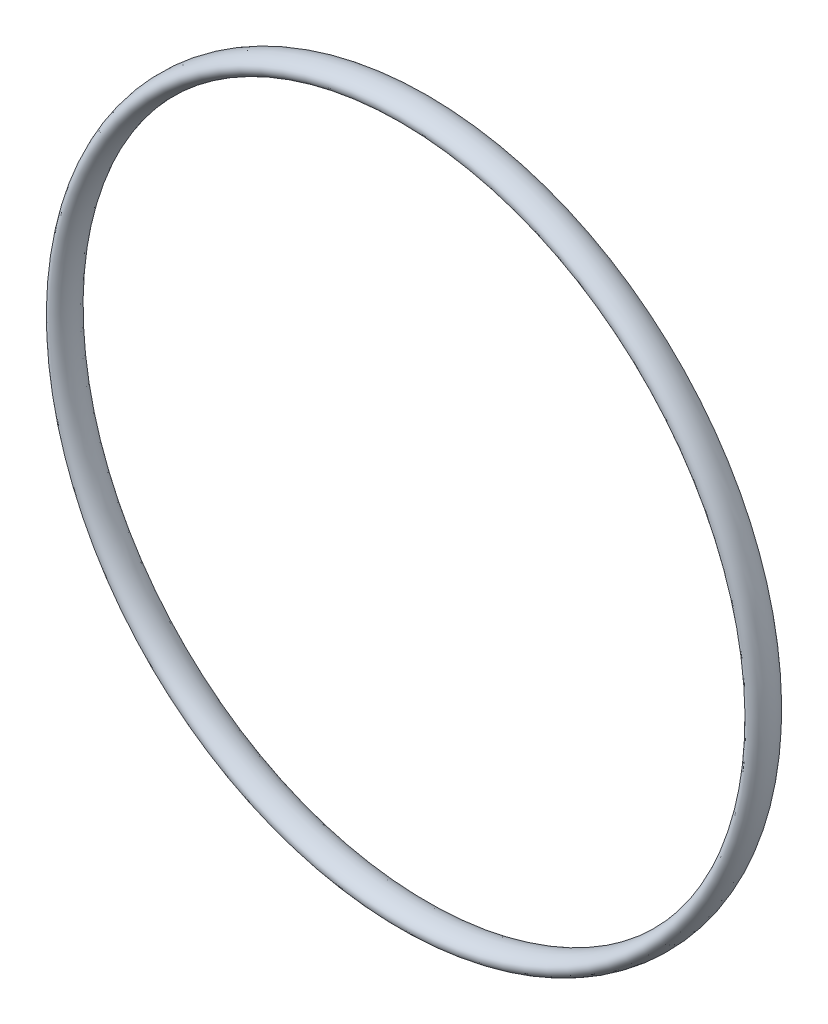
ISO-10303-21;
HEADER;
FILE_DESCRIPTION(('STEP AP214'),'2;1');
FILE_NAME('part.step','',(''),(''),'','','');
FILE_SCHEMA(('AUTOMOTIVE_DESIGN { 1 0 10303 214 1 1 1 1 }'));
ENDSEC;
DATA;
#1=APPLICATION_CONTEXT('core data for automotive mechanical design processes');
#2=APPLICATION_PROTOCOL_DEFINITION('international standard','automotive_design',2000,#1);
#3=PRODUCT_CONTEXT('',#1,'mechanical');
#4=PRODUCT('Part','Part','',(#3));
#5=PRODUCT_RELATED_PRODUCT_CATEGORY('part','',(#4));
#6=PRODUCT_DEFINITION_FORMATION('','',#4);
#7=PRODUCT_DEFINITION_CONTEXT('part definition',#1,'design');
#8=PRODUCT_DEFINITION('design','',#6,#7);
#9=PRODUCT_DEFINITION_SHAPE('','',#8);
#10=(LENGTH_UNIT() NAMED_UNIT(*) SI_UNIT(.MILLI.,.METRE.));
#11=(NAMED_UNIT(*) PLANE_ANGLE_UNIT() SI_UNIT($,.RADIAN.));
#12=(NAMED_UNIT(*) SI_UNIT($,.STERADIAN.) SOLID_ANGLE_UNIT());
#13=UNCERTAINTY_MEASURE_WITH_UNIT(LENGTH_MEASURE(1.E-05),#10,'distance_accuracy_value','');
#14=(GEOMETRIC_REPRESENTATION_CONTEXT(3) GLOBAL_UNCERTAINTY_ASSIGNED_CONTEXT((#13)) GLOBAL_UNIT_ASSIGNED_CONTEXT((#10,
#11,#12)) REPRESENTATION_CONTEXT('',''));
#15=CARTESIAN_POINT('',(0.,0.,0.));
#16=DIRECTION('',(0.,0.,1.));
#17=DIRECTION('',(1.,0.,0.));
#18=AXIS2_PLACEMENT_3D('',#15,#16,#17);
#19=CARTESIAN_POINT('',(0.,53.35,-2.4));
#20=DIRECTION('',(1.,0.,0.));
#21=DIRECTION('',(0.,0.,-1.));
#22=AXIS2_PLACEMENT_3D('',#19,#20,#21);
#23=ELLIPSE('',#22,2.4,1.45);
#24=CARTESIAN_POINT('',(0.,0.,0.));
#25=DIRECTION('',(0.,0.,1.));
#26=AXIS1_PLACEMENT('',#24,#25);
#27=SURFACE_OF_REVOLUTION('',#23,#26);
#28=ADVANCED_FACE('F28',(),#27,.T.);
#29=CLOSED_SHELL('',(#28));
#30=MANIFOLD_SOLID_BREP('B2',#29);
#31=ADVANCED_BREP_SHAPE_REPRESENTATION('',(#18,#30),#14);
#32=SHAPE_DEFINITION_REPRESENTATION(#9,#31);
ENDSEC;
END-ISO-10303-21;
